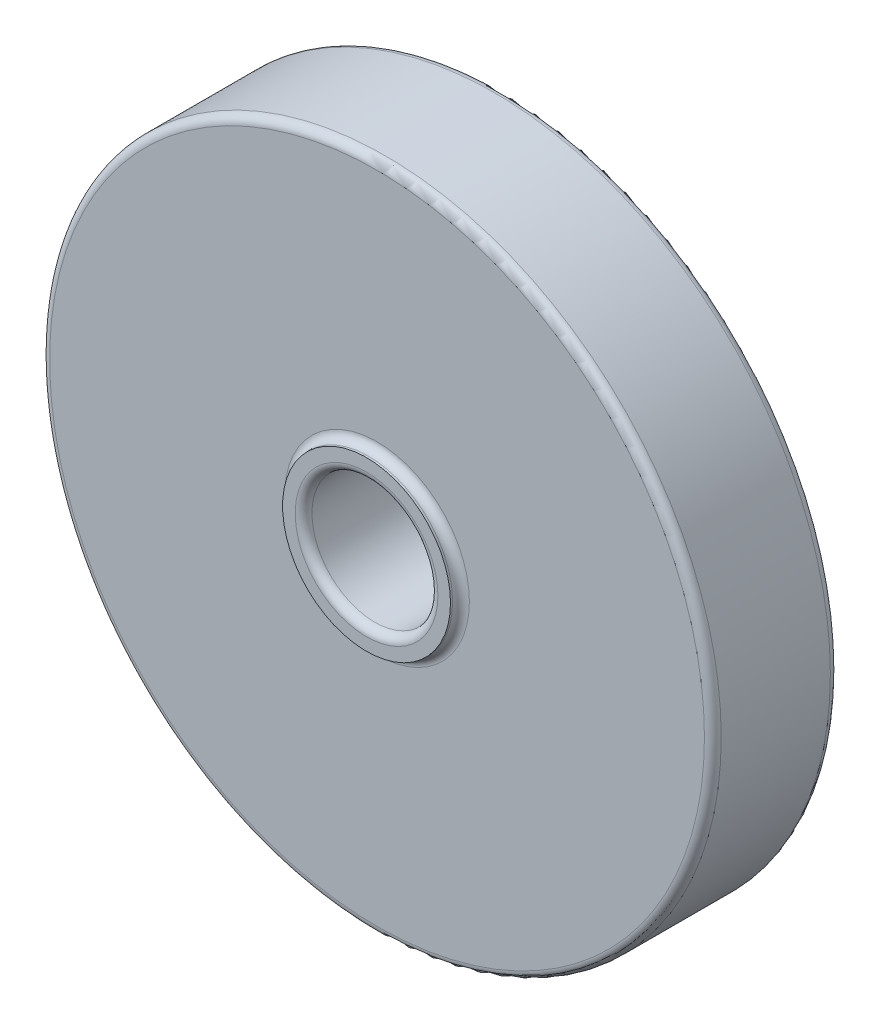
ISO-10303-21;
HEADER;
FILE_DESCRIPTION(('STEP AP214'),'2;1');
FILE_NAME('part.step','',(''),(''),'','','');
FILE_SCHEMA(('AUTOMOTIVE_DESIGN { 1 0 10303 214 1 1 1 1 }'));
ENDSEC;
DATA;
#1=APPLICATION_CONTEXT('core data for automotive mechanical design processes');
#2=APPLICATION_PROTOCOL_DEFINITION('international standard','automotive_design',2000,#1);
#3=PRODUCT_CONTEXT('',#1,'mechanical');
#4=PRODUCT('Part','Part','',(#3));
#5=PRODUCT_RELATED_PRODUCT_CATEGORY('part','',(#4));
#6=PRODUCT_DEFINITION_FORMATION('','',#4);
#7=PRODUCT_DEFINITION_CONTEXT('part definition',#1,'design');
#8=PRODUCT_DEFINITION('design','',#6,#7);
#9=PRODUCT_DEFINITION_SHAPE('','',#8);
#10=(LENGTH_UNIT() NAMED_UNIT(*) SI_UNIT(.MILLI.,.METRE.));
#11=(NAMED_UNIT(*) PLANE_ANGLE_UNIT() SI_UNIT($,.RADIAN.));
#12=(NAMED_UNIT(*) SI_UNIT($,.STERADIAN.) SOLID_ANGLE_UNIT());
#13=UNCERTAINTY_MEASURE_WITH_UNIT(LENGTH_MEASURE(1.E-05),#10,'distance_accuracy_value','');
#14=(GEOMETRIC_REPRESENTATION_CONTEXT(3) GLOBAL_UNCERTAINTY_ASSIGNED_CONTEXT((#13)) GLOBAL_UNIT_ASSIGNED_CONTEXT((#10,
#11,#12)) REPRESENTATION_CONTEXT('',''));
#15=CARTESIAN_POINT('',(0.,0.,0.));
#16=DIRECTION('',(0.,0.,1.));
#17=DIRECTION('',(1.,0.,0.));
#18=AXIS2_PLACEMENT_3D('',#15,#16,#17);
#19=CARTESIAN_POINT('',(0.,0.,3.));
#20=DIRECTION('',(0.,0.,1.));
#21=DIRECTION('',(1.,0.,0.));
#22=AXIS2_PLACEMENT_3D('',#19,#20,#21);
#23=PLANE('',#22);
#24=CARTESIAN_POINT('',(0.,0.,3.));
#25=DIRECTION('',(0.,0.,1.));
#26=DIRECTION('',(1.,0.,0.));
#27=AXIS2_PLACEMENT_3D('',#24,#25,#26);
#28=CIRCLE('',#27,2.2);
#29=CARTESIAN_POINT('',(2.2,0.,3.));
#30=VERTEX_POINT('',#29);
#31=EDGE_CURVE('E10',#30,#30,#28,.F.);
#32=ORIENTED_EDGE('',*,*,#31,.T.);
#33=EDGE_LOOP('',(#32));
#34=FACE_BOUND('',#33,.T.);
#35=CARTESIAN_POINT('',(0.,0.,3.));
#36=DIRECTION('',(0.,0.,1.));
#37=DIRECTION('',(1.,0.,0.));
#38=AXIS2_PLACEMENT_3D('',#35,#36,#37);
#39=CIRCLE('',#38,7.8);
#40=CARTESIAN_POINT('',(7.8,0.,3.));
#41=VERTEX_POINT('',#40);
#42=EDGE_CURVE('E36',#41,#41,#39,.T.);
#43=ORIENTED_EDGE('',*,*,#42,.T.);
#44=EDGE_LOOP('',(#43));
#45=FACE_BOUND('',#44,.T.);
#46=ADVANCED_FACE('F29',(#34,#45),#23,.T.);
#47=CARTESIAN_POINT('',(0.,0.,0.));
#48=DIRECTION('',(0.,0.,1.));
#49=DIRECTION('',(1.,0.,0.));
#50=AXIS2_PLACEMENT_3D('',#47,#48,#49);
#51=PLANE('',#50);
#52=CARTESIAN_POINT('',(0.,0.,0.));
#53=DIRECTION('',(0.,0.,1.));
#54=DIRECTION('',(1.,0.,0.));
#55=AXIS2_PLACEMENT_3D('',#52,#53,#54);
#56=CIRCLE('',#55,7.8);
#57=CARTESIAN_POINT('',(7.8,0.,0.));
#58=VERTEX_POINT('',#57);
#59=EDGE_CURVE('E55',#58,#58,#56,.F.);
#60=ORIENTED_EDGE('',*,*,#59,.T.);
#61=EDGE_LOOP('',(#60));
#62=FACE_BOUND('',#61,.T.);
#63=CARTESIAN_POINT('',(0.,0.,0.));
#64=DIRECTION('',(0.,0.,1.));
#65=DIRECTION('',(1.,0.,0.));
#66=AXIS2_PLACEMENT_3D('',#63,#64,#65);
#67=CIRCLE('',#66,1.7);
#68=CARTESIAN_POINT('',(1.7,0.,0.));
#69=VERTEX_POINT('',#68);
#70=EDGE_CURVE('E58',#69,#69,#67,.T.);
#71=ORIENTED_EDGE('',*,*,#70,.T.);
#72=EDGE_LOOP('',(#71));
#73=FACE_BOUND('',#72,.T.);
#74=ADVANCED_FACE('F90',(#62,#73),#51,.F.);
#75=CARTESIAN_POINT('',(0.,0.,3.));
#76=DIRECTION('',(0.,0.,-1.));
#77=DIRECTION('',(-1.,0.,0.));
#78=AXIS2_PLACEMENT_3D('',#75,#76,#77);
#79=CYLINDRICAL_SURFACE('',#78,8.);
#80=CARTESIAN_POINT('',(0.,0.,0.2));
#81=DIRECTION('',(0.,0.,1.));
#82=DIRECTION('',(1.,0.,0.));
#83=AXIS2_PLACEMENT_3D('',#80,#81,#82);
#84=CIRCLE('',#83,8.);
#85=CARTESIAN_POINT('',(8.,0.,0.2));
#86=VERTEX_POINT('',#85);
#87=EDGE_CURVE('E61',#86,#86,#84,.T.);
#88=ORIENTED_EDGE('',*,*,#87,.T.);
#89=EDGE_LOOP('',(#88));
#90=FACE_BOUND('',#89,.T.);
#91=CARTESIAN_POINT('',(0.,0.,2.8));
#92=DIRECTION('',(0.,0.,1.));
#93=DIRECTION('',(1.,0.,0.));
#94=AXIS2_PLACEMENT_3D('',#91,#92,#93);
#95=CIRCLE('',#94,8.);
#96=CARTESIAN_POINT('',(8.,0.,2.8));
#97=VERTEX_POINT('',#96);
#98=EDGE_CURVE('E64',#97,#97,#95,.F.);
#99=ORIENTED_EDGE('',*,*,#98,.T.);
#100=EDGE_LOOP('',(#99));
#101=FACE_BOUND('',#100,.T.);
#102=ADVANCED_FACE('F31',(#90,#101),#79,.T.);
#103=CARTESIAN_POINT('',(0.,0.,3.));
#104=DIRECTION('',(0.,0.,-1.));
#105=DIRECTION('',(-1.,0.,0.));
#106=AXIS2_PLACEMENT_3D('',#103,#104,#105);
#107=CYLINDRICAL_SURFACE('',#106,1.5);
#108=CARTESIAN_POINT('',(0.,0.,3.05));
#109=DIRECTION('',(0.,0.,1.));
#110=DIRECTION('',(1.,0.,0.));
#111=AXIS2_PLACEMENT_3D('',#108,#109,#110);
#112=CIRCLE('',#111,1.5);
#113=CARTESIAN_POINT('',(1.5,0.,3.05));
#114=VERTEX_POINT('',#113);
#115=EDGE_CURVE('E49',#114,#114,#112,.T.);
#116=ORIENTED_EDGE('',*,*,#115,.T.);
#117=EDGE_LOOP('',(#116));
#118=FACE_BOUND('',#117,.T.);
#119=CARTESIAN_POINT('',(0.,0.,0.2));
#120=DIRECTION('',(0.,0.,1.));
#121=DIRECTION('',(1.,0.,0.));
#122=AXIS2_PLACEMENT_3D('',#119,#120,#121);
#123=CIRCLE('',#122,1.5);
#124=CARTESIAN_POINT('',(1.5,0.,0.2));
#125=VERTEX_POINT('',#124);
#126=EDGE_CURVE('E52',#125,#125,#123,.F.);
#127=ORIENTED_EDGE('',*,*,#126,.T.);
#128=EDGE_LOOP('',(#127));
#129=FACE_BOUND('',#128,.T.);
#130=ADVANCED_FACE('F85',(#118,#129),#107,.F.);
#131=CARTESIAN_POINT('',(0.,0.,3.25));
#132=DIRECTION('',(0.,0.,1.));
#133=DIRECTION('',(1.,0.,0.));
#134=AXIS2_PLACEMENT_3D('',#131,#132,#133);
#135=PLANE('',#134);
#136=CARTESIAN_POINT('',(0.,0.,3.25));
#137=DIRECTION('',(0.,0.,1.));
#138=DIRECTION('',(1.,0.,0.));
#139=AXIS2_PLACEMENT_3D('',#136,#137,#138);
#140=CIRCLE('',#139,1.7);
#141=CARTESIAN_POINT('',(1.7,0.,3.25));
#142=VERTEX_POINT('',#141);
#143=EDGE_CURVE('E44',#142,#142,#140,.F.);
#144=ORIENTED_EDGE('',*,*,#143,.T.);
#145=EDGE_LOOP('',(#144));
#146=FACE_BOUND('',#145,.T.);
#147=CARTESIAN_POINT('',(0.,0.,3.25));
#148=DIRECTION('',(0.,0.,1.));
#149=DIRECTION('',(1.,0.,0.));
#150=AXIS2_PLACEMENT_3D('',#147,#148,#149);
#151=CIRCLE('',#150,2.);
#152=CARTESIAN_POINT('',(2.,0.,3.25));
#153=VERTEX_POINT('',#152);
#154=EDGE_CURVE('E67',#153,#153,#151,.T.);
#155=ORIENTED_EDGE('',*,*,#154,.T.);
#156=EDGE_LOOP('',(#155));
#157=FACE_BOUND('',#156,.T.);
#158=ADVANCED_FACE('F71',(#146,#157),#135,.T.);
#159=CARTESIAN_POINT('',(0.,0.,3.25));
#160=DIRECTION('',(0.,0.,-1.));
#161=DIRECTION('',(-1.,0.,0.));
#162=AXIS2_PLACEMENT_3D('',#159,#160,#161);
#163=CYLINDRICAL_SURFACE('',#162,2.);
#164=CARTESIAN_POINT('',(0.,0.,3.2));
#165=DIRECTION('',(0.,0.,1.));
#166=DIRECTION('',(1.,0.,0.));
#167=AXIS2_PLACEMENT_3D('',#164,#165,#166);
#168=CIRCLE('',#167,2.);
#169=CARTESIAN_POINT('',(2.,0.,3.2));
#170=VERTEX_POINT('',#169);
#171=EDGE_CURVE('E40',#170,#170,#168,.T.);
#172=ORIENTED_EDGE('',*,*,#171,.T.);
#173=EDGE_LOOP('',(#172));
#174=FACE_BOUND('',#173,.T.);
#175=ORIENTED_EDGE('',*,*,#154,.F.);
#176=EDGE_LOOP('',(#175));
#177=FACE_BOUND('',#176,.T.);
#178=ADVANCED_FACE('F73',(#174,#177),#163,.T.);
#179=CARTESIAN_POINT('',(0.,0.,0.2));
#180=DIRECTION('',(0.,0.,1.));
#181=DIRECTION('',(1.,0.,0.));
#182=AXIS2_PLACEMENT_3D('',#179,#180,#181);
#183=TOROIDAL_SURFACE('',#182,7.8,0.2);
#184=ORIENTED_EDGE('',*,*,#59,.F.);
#185=EDGE_LOOP('',(#184));
#186=FACE_BOUND('',#185,.T.);
#187=ORIENTED_EDGE('',*,*,#87,.F.);
#188=EDGE_LOOP('',(#187));
#189=FACE_BOUND('',#188,.T.);
#190=ADVANCED_FACE('F75',(#186,#189),#183,.T.);
#191=CARTESIAN_POINT('',(0.,0.,3.05));
#192=DIRECTION('',(0.,0.,1.));
#193=DIRECTION('',(1.,0.,0.));
#194=AXIS2_PLACEMENT_3D('',#191,#192,#193);
#195=TOROIDAL_SURFACE('',#194,1.7,0.2);
#196=ORIENTED_EDGE('',*,*,#143,.F.);
#197=EDGE_LOOP('',(#196));
#198=FACE_BOUND('',#197,.T.);
#199=ORIENTED_EDGE('',*,*,#115,.F.);
#200=EDGE_LOOP('',(#199));
#201=FACE_BOUND('',#200,.T.);
#202=ADVANCED_FACE('F82',(#198,#201),#195,.T.);
#203=CARTESIAN_POINT('',(0.,0.,0.2));
#204=DIRECTION('',(0.,0.,1.));
#205=DIRECTION('',(1.,0.,0.));
#206=AXIS2_PLACEMENT_3D('',#203,#204,#205);
#207=TOROIDAL_SURFACE('',#206,1.7,0.2);
#208=ORIENTED_EDGE('',*,*,#126,.F.);
#209=EDGE_LOOP('',(#208));
#210=FACE_BOUND('',#209,.T.);
#211=ORIENTED_EDGE('',*,*,#70,.F.);
#212=EDGE_LOOP('',(#211));
#213=FACE_BOUND('',#212,.T.);
#214=ADVANCED_FACE('F106',(#210,#213),#207,.T.);
#215=CARTESIAN_POINT('',(0.,0.,3.2));
#216=DIRECTION('',(0.,0.,1.));
#217=DIRECTION('',(1.,0.,0.));
#218=AXIS2_PLACEMENT_3D('',#215,#216,#217);
#219=TOROIDAL_SURFACE('',#218,2.2,0.2);
#220=ORIENTED_EDGE('',*,*,#31,.F.);
#221=EDGE_LOOP('',(#220));
#222=FACE_BOUND('',#221,.T.);
#223=ORIENTED_EDGE('',*,*,#171,.F.);
#224=EDGE_LOOP('',(#223));
#225=FACE_BOUND('',#224,.T.);
#226=ADVANCED_FACE('F109',(#222,#225),#219,.F.);
#227=CARTESIAN_POINT('',(0.,0.,2.8));
#228=DIRECTION('',(0.,0.,1.));
#229=DIRECTION('',(1.,0.,0.));
#230=AXIS2_PLACEMENT_3D('',#227,#228,#229);
#231=TOROIDAL_SURFACE('',#230,7.8,0.2);
#232=ORIENTED_EDGE('',*,*,#98,.F.);
#233=EDGE_LOOP('',(#232));
#234=FACE_BOUND('',#233,.T.);
#235=ORIENTED_EDGE('',*,*,#42,.F.);
#236=EDGE_LOOP('',(#235));
#237=FACE_BOUND('',#236,.T.);
#238=ADVANCED_FACE('F117',(#234,#237),#231,.T.);
#239=CLOSED_SHELL('',(#46,#74,#102,#130,#158,#178,#190,#202,#214,#226,#238));
#240=MANIFOLD_SOLID_BREP('B2',#239);
#241=ADVANCED_BREP_SHAPE_REPRESENTATION('',(#18,#240),#14);
#242=SHAPE_DEFINITION_REPRESENTATION(#9,#241);
ENDSEC;
END-ISO-10303-21;
